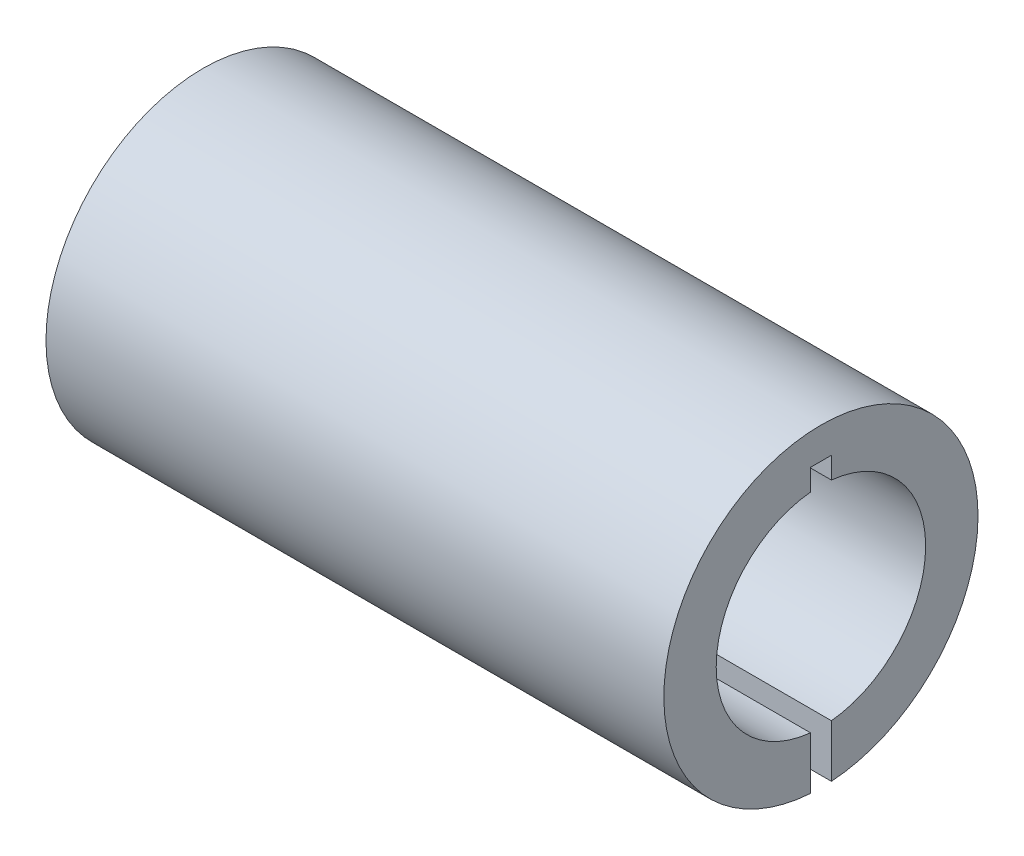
ISO-10303-21;
HEADER;
FILE_DESCRIPTION(('STEP AP214'),'2;1');
FILE_NAME('part.step','',(''),(''),'','','');
FILE_SCHEMA(('AUTOMOTIVE_DESIGN { 1 0 10303 214 1 1 1 1 }'));
ENDSEC;
DATA;
#1=APPLICATION_CONTEXT('core data for automotive mechanical design processes');
#2=APPLICATION_PROTOCOL_DEFINITION('international standard','automotive_design',2000,#1);
#3=PRODUCT_CONTEXT('',#1,'mechanical');
#4=PRODUCT('Part','Part','',(#3));
#5=PRODUCT_RELATED_PRODUCT_CATEGORY('part','',(#4));
#6=PRODUCT_DEFINITION_FORMATION('','',#4);
#7=PRODUCT_DEFINITION_CONTEXT('part definition',#1,'design');
#8=PRODUCT_DEFINITION('design','',#6,#7);
#9=PRODUCT_DEFINITION_SHAPE('','',#8);
#10=(LENGTH_UNIT() NAMED_UNIT(*) SI_UNIT(.MILLI.,.METRE.));
#11=(NAMED_UNIT(*) PLANE_ANGLE_UNIT() SI_UNIT($,.RADIAN.));
#12=(NAMED_UNIT(*) SI_UNIT($,.STERADIAN.) SOLID_ANGLE_UNIT());
#13=UNCERTAINTY_MEASURE_WITH_UNIT(LENGTH_MEASURE(1.E-05),#10,'distance_accuracy_value','');
#14=(GEOMETRIC_REPRESENTATION_CONTEXT(3) GLOBAL_UNCERTAINTY_ASSIGNED_CONTEXT((#13)) GLOBAL_UNIT_ASSIGNED_CONTEXT((#10,
#11,#12)) REPRESENTATION_CONTEXT('',''));
#15=CARTESIAN_POINT('',(0.,0.,0.));
#16=DIRECTION('',(0.,0.,1.));
#17=DIRECTION('',(1.,0.,0.));
#18=AXIS2_PLACEMENT_3D('',#15,#16,#17);
#19=CARTESIAN_POINT('',(29.5,-7.48331477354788,0.5));
#20=DIRECTION('',(0.,0.,1.));
#21=DIRECTION('',(1.,0.,0.));
#22=AXIS2_PLACEMENT_3D('',#19,#20,#21);
#23=PLANE('',#22);
#24=DIRECTION('',(0.,1.,0.));
#25=VECTOR('',#24,1.);
#26=CARTESIAN_POINT('',(0.,-7.48331477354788,0.5));
#27=LINE('',#26,#25);
#28=CARTESIAN_POINT('',(0.,-7.48331477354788,0.500000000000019));
#29=VERTEX_POINT('',#28);
#30=CARTESIAN_POINT('',(0.,-4.9749371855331,0.5));
#31=VERTEX_POINT('',#30);
#32=EDGE_CURVE('E118',#29,#31,#27,.T.);
#33=ORIENTED_EDGE('',*,*,#32,.T.);
#34=DIRECTION('',(1.,0.,0.));
#35=VECTOR('',#34,1.);
#36=CARTESIAN_POINT('',(-1.,-4.9749371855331,0.5));
#37=LINE('',#36,#35);
#38=CARTESIAN_POINT('',(29.5,-4.9749371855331,0.5));
#39=VERTEX_POINT('',#38);
#40=EDGE_CURVE('E40',#31,#39,#37,.T.);
#41=ORIENTED_EDGE('',*,*,#40,.T.);
#42=DIRECTION('',(0.,1.,0.));
#43=VECTOR('',#42,1.);
#44=CARTESIAN_POINT('',(29.5,-7.48331477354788,0.5));
#45=LINE('',#44,#43);
#46=CARTESIAN_POINT('',(29.5,-7.48331477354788,0.500000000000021));
#47=VERTEX_POINT('',#46);
#48=EDGE_CURVE('E134',#47,#39,#45,.T.);
#49=ORIENTED_EDGE('',*,*,#48,.F.);
#50=DIRECTION('',(-1.,0.,0.));
#51=VECTOR('',#50,1.);
#52=CARTESIAN_POINT('',(29.5,-7.48331477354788,0.500000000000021));
#53=LINE('',#52,#51);
#54=EDGE_CURVE('E126',#47,#29,#53,.T.);
#55=ORIENTED_EDGE('',*,*,#54,.T.);
#56=EDGE_LOOP('',(#33,#41,#49,#55));
#57=FACE_BOUND('',#56,.T.);
#58=ADVANCED_FACE('F16',(#57),#23,.F.);
#59=CARTESIAN_POINT('',(29.5,-7.48331477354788,-0.5));
#60=DIRECTION('',(0.,0.,1.));
#61=DIRECTION('',(1.,0.,0.));
#62=AXIS2_PLACEMENT_3D('',#59,#60,#61);
#63=PLANE('',#62);
#64=DIRECTION('',(1.,0.,0.));
#65=VECTOR('',#64,1.);
#66=CARTESIAN_POINT('',(-1.,-4.9749371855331,-0.5));
#67=LINE('',#66,#65);
#68=CARTESIAN_POINT('',(0.,-4.9749371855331,-0.5));
#69=VERTEX_POINT('',#68);
#70=CARTESIAN_POINT('',(29.5,-4.9749371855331,-0.5));
#71=VERTEX_POINT('',#70);
#72=EDGE_CURVE('E80',#69,#71,#67,.T.);
#73=ORIENTED_EDGE('',*,*,#72,.F.);
#74=DIRECTION('',(0.,1.,0.));
#75=VECTOR('',#74,1.);
#76=CARTESIAN_POINT('',(0.,-7.48331477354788,-0.5));
#77=LINE('',#76,#75);
#78=CARTESIAN_POINT('',(0.,-7.48331477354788,-0.5));
#79=VERTEX_POINT('',#78);
#80=EDGE_CURVE('E91',#79,#69,#77,.T.);
#81=ORIENTED_EDGE('',*,*,#80,.F.);
#82=DIRECTION('',(-1.,0.,0.));
#83=VECTOR('',#82,1.);
#84=CARTESIAN_POINT('',(29.5,-7.48331477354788,-0.5));
#85=LINE('',#84,#83);
#86=CARTESIAN_POINT('',(29.5,-7.48331477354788,-0.5));
#87=VERTEX_POINT('',#86);
#88=EDGE_CURVE('E145',#87,#79,#85,.T.);
#89=ORIENTED_EDGE('',*,*,#88,.F.);
#90=DIRECTION('',(0.,1.,0.));
#91=VECTOR('',#90,1.);
#92=CARTESIAN_POINT('',(29.5,-7.48331477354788,-0.5));
#93=LINE('',#92,#91);
#94=EDGE_CURVE('E93',#87,#71,#93,.T.);
#95=ORIENTED_EDGE('',*,*,#94,.T.);
#96=EDGE_LOOP('',(#73,#81,#89,#95));
#97=FACE_BOUND('',#96,.T.);
#98=ADVANCED_FACE('F90',(#97),#63,.T.);
#99=CARTESIAN_POINT('',(29.5,4.9749371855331,0.5));
#100=VERTEX_POINT('',#99);
#101=CARTESIAN_POINT('',(29.5,6.,0.5));
#102=VERTEX_POINT('',#101);
#103=EDGE_CURVE('E109',#100,#102,#45,.T.);
#104=ORIENTED_EDGE('',*,*,#103,.F.);
#105=DIRECTION('',(1.,0.,0.));
#106=VECTOR('',#105,1.);
#107=CARTESIAN_POINT('',(-1.,4.9749371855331,0.5));
#108=LINE('',#107,#106);
#109=CARTESIAN_POINT('',(0.,4.9749371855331,0.5));
#110=VERTEX_POINT('',#109);
#111=EDGE_CURVE('E160',#100,#110,#108,.F.);
#112=ORIENTED_EDGE('',*,*,#111,.T.);
#113=CARTESIAN_POINT('',(0.,6.,0.5));
#114=VERTEX_POINT('',#113);
#115=EDGE_CURVE('E122',#110,#114,#27,.T.);
#116=ORIENTED_EDGE('',*,*,#115,.T.);
#117=DIRECTION('',(-1.,0.,0.));
#118=VECTOR('',#117,1.);
#119=CARTESIAN_POINT('',(29.5,6.,0.5));
#120=LINE('',#119,#118);
#121=EDGE_CURVE('E86',#102,#114,#120,.T.);
#122=ORIENTED_EDGE('',*,*,#121,.F.);
#123=EDGE_LOOP('',(#104,#112,#116,#122));
#124=FACE_BOUND('',#123,.T.);
#125=ADVANCED_FACE('F18',(#124),#23,.F.);
#126=CARTESIAN_POINT('',(29.5,6.,-0.5));
#127=DIRECTION('',(0.,-1.,0.));
#128=DIRECTION('',(-1.,0.,0.));
#129=AXIS2_PLACEMENT_3D('',#126,#127,#128);
#130=PLANE('',#129);
#131=DIRECTION('',(0.,0.,1.));
#132=VECTOR('',#131,1.);
#133=CARTESIAN_POINT('',(0.,6.,-0.5));
#134=LINE('',#133,#132);
#135=CARTESIAN_POINT('',(0.,6.,-0.5));
#136=VERTEX_POINT('',#135);
#137=EDGE_CURVE('E112',#136,#114,#134,.T.);
#138=ORIENTED_EDGE('',*,*,#137,.F.);
#139=DIRECTION('',(-1.,0.,0.));
#140=VECTOR('',#139,1.);
#141=CARTESIAN_POINT('',(29.5,6.,-0.5));
#142=LINE('',#141,#140);
#143=CARTESIAN_POINT('',(29.5,6.,-0.5));
#144=VERTEX_POINT('',#143);
#145=EDGE_CURVE('E141',#144,#136,#142,.T.);
#146=ORIENTED_EDGE('',*,*,#145,.F.);
#147=DIRECTION('',(0.,0.,1.));
#148=VECTOR('',#147,1.);
#149=CARTESIAN_POINT('',(29.5,6.,-0.5));
#150=LINE('',#149,#148);
#151=EDGE_CURVE('E130',#144,#102,#150,.T.);
#152=ORIENTED_EDGE('',*,*,#151,.T.);
#153=ORIENTED_EDGE('',*,*,#121,.T.);
#154=EDGE_LOOP('',(#138,#146,#152,#153));
#155=FACE_BOUND('',#154,.T.);
#156=ADVANCED_FACE('F189',(#155),#130,.T.);
#157=DIRECTION('',(1.,0.,0.));
#158=VECTOR('',#157,1.);
#159=CARTESIAN_POINT('',(-1.,4.9749371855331,-0.5));
#160=LINE('',#159,#158);
#161=CARTESIAN_POINT('',(29.5,4.9749371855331,-0.5));
#162=VERTEX_POINT('',#161);
#163=CARTESIAN_POINT('',(0.,4.9749371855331,-0.5));
#164=VERTEX_POINT('',#163);
#165=EDGE_CURVE('E32',#162,#164,#160,.F.);
#166=ORIENTED_EDGE('',*,*,#165,.F.);
#167=EDGE_CURVE('E129',#162,#144,#93,.T.);
#168=ORIENTED_EDGE('',*,*,#167,.T.);
#169=ORIENTED_EDGE('',*,*,#145,.T.);
#170=EDGE_CURVE('E103',#164,#136,#77,.T.);
#171=ORIENTED_EDGE('',*,*,#170,.F.);
#172=EDGE_LOOP('',(#166,#168,#169,#171));
#173=FACE_BOUND('',#172,.T.);
#174=ADVANCED_FACE('F193',(#173),#63,.T.);
#175=CARTESIAN_POINT('',(29.5,0.,0.));
#176=DIRECTION('',(-1.,0.,0.));
#177=DIRECTION('',(0.,0.,1.));
#178=AXIS2_PLACEMENT_3D('',#175,#176,#177);
#179=CYLINDRICAL_SURFACE('',#178,7.5);
#180=CARTESIAN_POINT('',(0.,0.,0.));
#181=DIRECTION('',(1.,0.,0.));
#182=DIRECTION('',(0.,0.,-1.));
#183=AXIS2_PLACEMENT_3D('',#180,#181,#182);
#184=CIRCLE('',#183,7.5);
#185=EDGE_CURVE('E101',#79,#29,#184,.T.);
#186=ORIENTED_EDGE('',*,*,#185,.T.);
#187=ORIENTED_EDGE('',*,*,#54,.F.);
#188=CARTESIAN_POINT('',(29.5,0.,0.));
#189=DIRECTION('',(1.,0.,0.));
#190=DIRECTION('',(0.,0.,-1.));
#191=AXIS2_PLACEMENT_3D('',#188,#189,#190);
#192=CIRCLE('',#191,7.5);
#193=EDGE_CURVE('E123',#87,#47,#192,.T.);
#194=ORIENTED_EDGE('',*,*,#193,.F.);
#195=ORIENTED_EDGE('',*,*,#88,.T.);
#196=EDGE_LOOP('',(#186,#187,#194,#195));
#197=FACE_BOUND('',#196,.T.);
#198=ADVANCED_FACE('F151',(#197),#179,.T.);
#199=CARTESIAN_POINT('',(29.5,0.,0.));
#200=DIRECTION('',(1.,0.,0.));
#201=DIRECTION('',(0.,0.,-1.));
#202=AXIS2_PLACEMENT_3D('',#199,#200,#201);
#203=PLANE('',#202);
#204=CARTESIAN_POINT('',(29.5,0.,0.));
#205=DIRECTION('',(1.,0.,0.));
#206=DIRECTION('',(0.,0.,-1.));
#207=AXIS2_PLACEMENT_3D('',#204,#205,#206);
#208=CIRCLE('',#207,5.);
#209=EDGE_CURVE('E162',#100,#39,#208,.T.);
#210=ORIENTED_EDGE('',*,*,#209,.F.);
#211=ORIENTED_EDGE('',*,*,#103,.T.);
#212=ORIENTED_EDGE('',*,*,#151,.F.);
#213=ORIENTED_EDGE('',*,*,#167,.F.);
#214=EDGE_CURVE('E95',#71,#162,#208,.T.);
#215=ORIENTED_EDGE('',*,*,#214,.F.);
#216=ORIENTED_EDGE('',*,*,#94,.F.);
#217=ORIENTED_EDGE('',*,*,#193,.T.);
#218=ORIENTED_EDGE('',*,*,#48,.T.);
#219=EDGE_LOOP('',(#210,#211,#212,#213,#215,#216,#217,#218));
#220=FACE_BOUND('',#219,.T.);
#221=ADVANCED_FACE('F156',(#220),#203,.T.);
#222=CARTESIAN_POINT('',(0.,0.,0.));
#223=DIRECTION('',(1.,0.,0.));
#224=DIRECTION('',(0.,0.,-1.));
#225=AXIS2_PLACEMENT_3D('',#222,#223,#224);
#226=PLANE('',#225);
#227=ORIENTED_EDGE('',*,*,#115,.F.);
#228=CARTESIAN_POINT('',(0.,0.,0.));
#229=DIRECTION('',(1.,0.,0.));
#230=DIRECTION('',(0.,0.,-1.));
#231=AXIS2_PLACEMENT_3D('',#228,#229,#230);
#232=CIRCLE('',#231,5.);
#233=EDGE_CURVE('E10',#110,#31,#232,.T.);
#234=ORIENTED_EDGE('',*,*,#233,.T.);
#235=ORIENTED_EDGE('',*,*,#32,.F.);
#236=ORIENTED_EDGE('',*,*,#185,.F.);
#237=ORIENTED_EDGE('',*,*,#80,.T.);
#238=EDGE_CURVE('E20',#69,#164,#232,.T.);
#239=ORIENTED_EDGE('',*,*,#238,.T.);
#240=ORIENTED_EDGE('',*,*,#170,.T.);
#241=ORIENTED_EDGE('',*,*,#137,.T.);
#242=EDGE_LOOP('',(#227,#234,#235,#236,#237,#239,#240,#241));
#243=FACE_BOUND('',#242,.T.);
#244=ADVANCED_FACE('F99',(#243),#226,.F.);
#245=CARTESIAN_POINT('',(-1.,0.,0.));
#246=DIRECTION('',(1.,0.,0.));
#247=DIRECTION('',(0.,1.,0.));
#248=AXIS2_PLACEMENT_3D('',#245,#246,#247);
#249=CYLINDRICAL_SURFACE('',#248,5.);
#250=ORIENTED_EDGE('',*,*,#214,.T.);
#251=ORIENTED_EDGE('',*,*,#165,.T.);
#252=ORIENTED_EDGE('',*,*,#238,.F.);
#253=ORIENTED_EDGE('',*,*,#72,.T.);
#254=EDGE_LOOP('',(#250,#251,#252,#253));
#255=FACE_BOUND('',#254,.T.);
#256=ADVANCED_FACE('F79',(#255),#249,.F.);
#257=ORIENTED_EDGE('',*,*,#209,.T.);
#258=ORIENTED_EDGE('',*,*,#40,.F.);
#259=ORIENTED_EDGE('',*,*,#233,.F.);
#260=ORIENTED_EDGE('',*,*,#111,.F.);
#261=EDGE_LOOP('',(#257,#258,#259,#260));
#262=FACE_BOUND('',#261,.T.);
#263=ADVANCED_FACE('F253',(#262),#249,.F.);
#264=CLOSED_SHELL('',(#58,#98,#125,#156,#174,#198,#221,#244,#256,#263));
#265=MANIFOLD_SOLID_BREP('B1',#264);
#266=ADVANCED_BREP_SHAPE_REPRESENTATION('',(#18,#265),#14);
#267=SHAPE_DEFINITION_REPRESENTATION(#9,#266);
ENDSEC;
END-ISO-10303-21;
